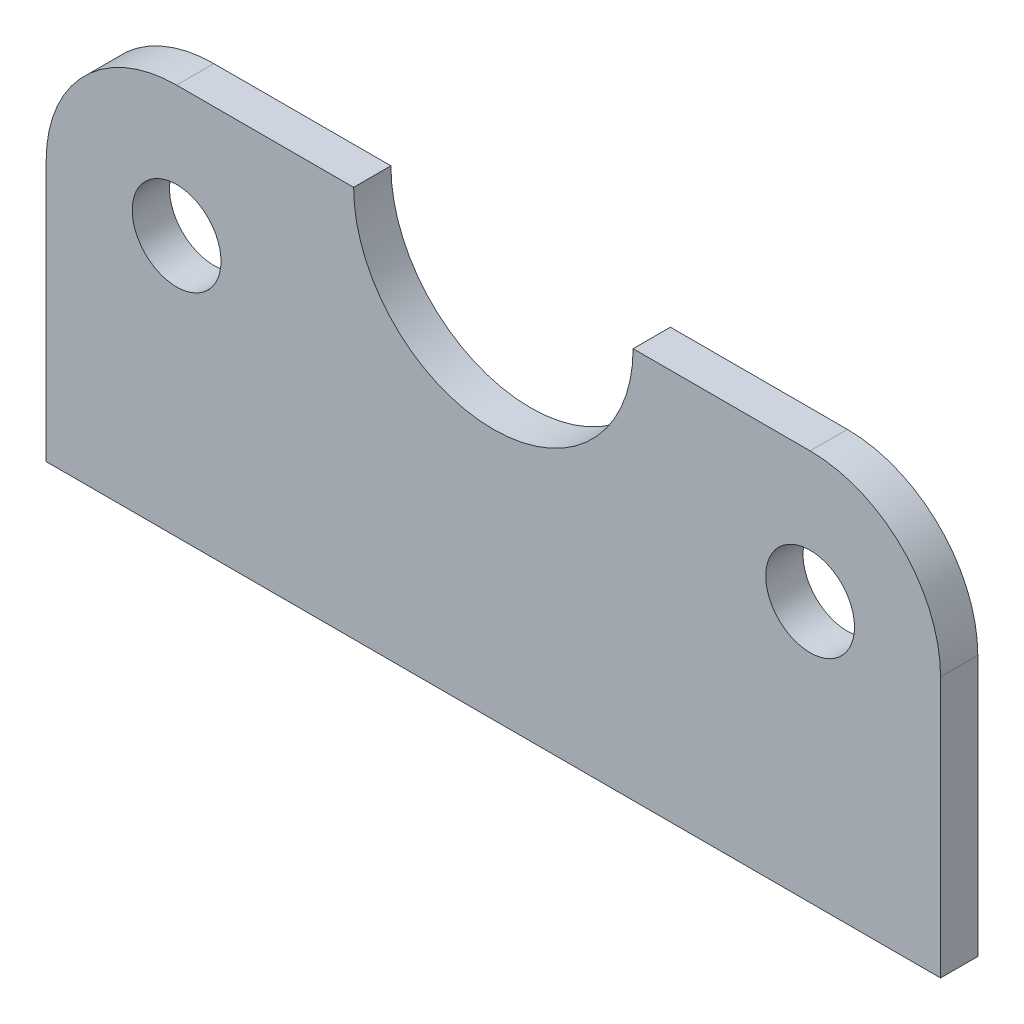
from build123d import *

# Parameters (mm, degrees)
BASE_EXTRUDE_DEPTH          = 4.233333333
F_3_8_CLEARANCE_HOLE1_D     = 10.0838
F_3_8_CLEARANCE_HOLE1_DEPTH = 19.05
F_3_8_CLEARANCE_HOLE1_TIP   = 3.029479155


with BuildPart() as part:
    # Sketch2 → Base-Extrude (new body)
    with BuildSketch(Plane.XY):
        with BuildLine():
            Line((0, 0), (0, 29.633333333))
            ThreePointArc((0, 29.633333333), (-4.339701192, 40.110298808), (-14.816666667, 44.45))
            Line((-14.816666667, 44.45), (-34.925, 44.45))
            ThreePointArc((-34.925, 44.45), (-50.8, 28.575), (-66.675, 44.45))
            Line((-66.675, 44.45), (-86.783333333, 44.45))
            ThreePointArc((-86.783333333, 44.45), (-97.260298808, 40.110298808), (-101.6, 29.633333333))
            Line((-101.6, 29.633333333), (-101.6, 0))
            Line((-101.6, 0), (0, 0))
        make_face()
    extrude(amount=-BASE_EXTRUDE_DEPTH)

    # 3_8 Clearance Hole1
    with Locations(Plane.XY):
        with Locations((-86.783333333, 29.633333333), (-14.816666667, 29.633333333)):
            Hole(F_3_8_CLEARANCE_HOLE1_D / 2, depth=F_3_8_CLEARANCE_HOLE1_DEPTH)
            with Locations((0, 0, -(F_3_8_CLEARANCE_HOLE1_DEPTH + F_3_8_CLEARANCE_HOLE1_TIP / 2))):  # 118° drill point
                Cone(0, F_3_8_CLEARANCE_HOLE1_D / 2, F_3_8_CLEARANCE_HOLE1_TIP, mode=Mode.SUBTRACT)


solid = part.part
